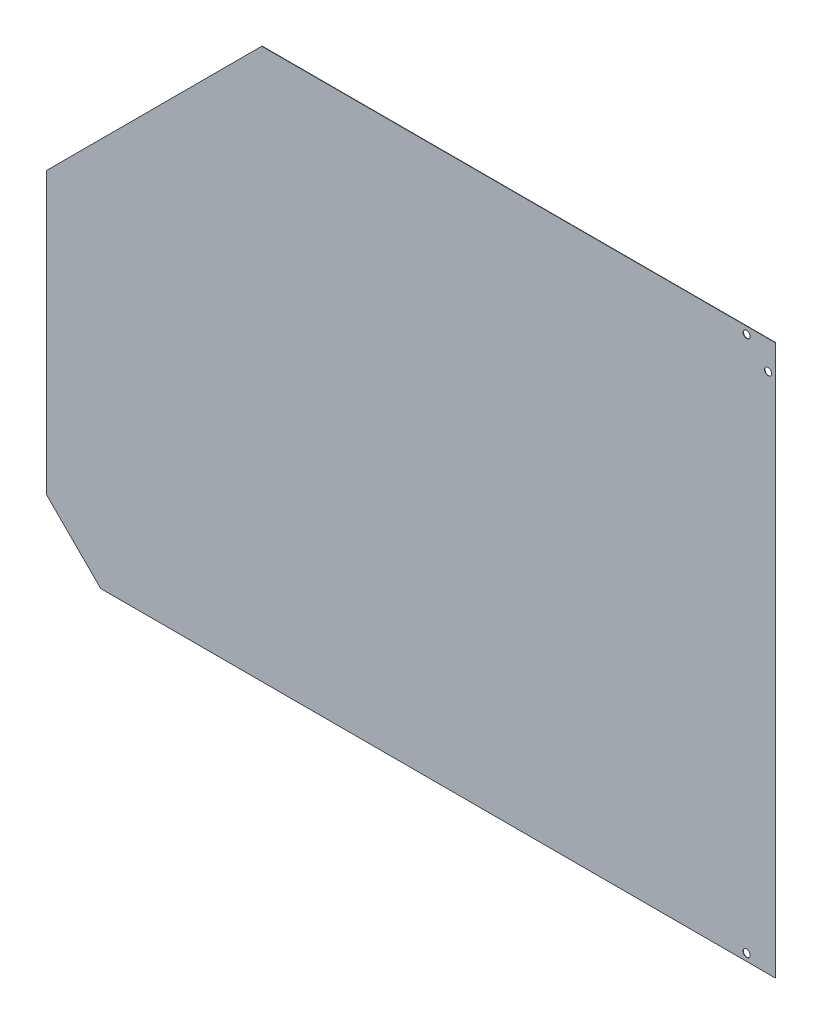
from build123d import *

# Parameters (mm, degrees)
EXTRUSION1_DEPTH        = 0.5
ESQUISSE3_R             = 4.903594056
ESQUISSE3_R_2           = 4.973149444
ENL_V_MAT_EXTRU_1_DEPTH = 10
ENL_V_MAT_EXTRU_2_DEPTH = 10
ESQUISSE5_R             = 5
ENL_V_MAT_EXTRU_3_DEPTH = 401


with BuildPart() as part:
    # Esquisse1 → Extrusion1 (new body)
    with BuildSketch(Plane.XY):
        Polygon((-718.58, 770), (-1020, 468.58), (-1020, 0), (0, 0), (0, 770), align=None)
    extrude(amount=EXTRUSION1_DEPTH)

    # Esquisse3 → Enl_v. mat.-Extru.1 (cut)
    with BuildSketch(Plane.XY.offset(0.5)):
        with Locations((-40, 760)):
            Circle(ESQUISSE3_R)
        with Locations((-10, 730)):
            Circle(ESQUISSE3_R_2)
    extrude(amount=-ENL_V_MAT_EXTRU_1_DEPTH, mode=Mode.SUBTRACT)

    # Esquisse4 → Enl_v. mat.-Extru.2 (cut)
    with BuildSketch(Plane(origin=(0, 0, 0), x_dir=(-1, 0, 0), z_dir=(0, 0, -1))):
        Polygon((1020, 75.962894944), (944.037105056, 0), (1020, 0), align=None)
    extrude(amount=-ENL_V_MAT_EXTRU_2_DEPTH, mode=Mode.SUBTRACT)

    # Esquisse5 → Enl_v. mat.-Extru.3 (cut)
    with BuildSketch(Plane(origin=(0, 0, 0), x_dir=(-1, 0, 0), z_dir=(0, 0, -1))):
        with Locations((40, 10)):
            Circle(ESQUISSE5_R)
    extrude(amount=-ENL_V_MAT_EXTRU_3_DEPTH, mode=Mode.SUBTRACT)


solid = part.part
